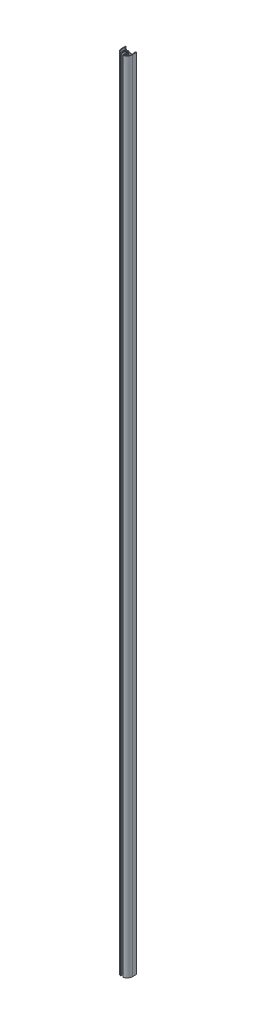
from build123d import *

# Parameters (mm, degrees)
AUFSATZ_LINEAR_AUSTRAGEN1_DEPTH = 2200


with BuildPart() as part:
    # Skizze1 → Aufsatz-Linear austragen1 (new body)
    with BuildSketch(Plane(origin=(0, 0, 0), x_dir=(1, 0, 0), z_dir=(0, 1, 0))):
        with BuildLine():
            Line((-1.200069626, 3.674560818), (-1.200069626, 1.274560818))
            Line((-1.200069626, 1.274560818), (-3.000069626, 1.274560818))
            Line((-3.000069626, 1.274560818), (-3.000069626, -2.275439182))
            Line((-3.000069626, -2.275439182), (-3.250069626, -2.525439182))
            Line((-3.250069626, -2.525439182), (-3.300069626, -2.525439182))
            Line((-3.300069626, -2.525439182), (-3.300069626, -9.025439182))
            Line((-3.300069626, -9.025439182), (-3.200069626, -9.025439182))
            Line((-3.200069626, -9.025439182), (-2.950069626, -9.275439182))
            Line((-2.950069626, -9.275439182), (-2.950069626, -12.609028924))
            ThreePointArc((-2.950069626, -12.609028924), (-3.14715992, -13.006830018), (-3.583052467, -13.091020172))
            ThreePointArc((-3.583052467, -13.091020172), (-11.748706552, -7.734227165), (-15.000069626, 1.474560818))
            Line((-15.000069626, 1.474560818), (-15.000069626, 12.600441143))
            ThreePointArc((-15.000069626, 12.600441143), (-14.635651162, 13.081707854), (-14.073599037, 12.861444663))
            ThreePointArc((-14.073599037, 12.861444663), (-10.343110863, 8.618764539), (-5.400069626, 5.883217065))
            Line((-5.400069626, 5.883217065), (-5.400069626, 2.474560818))
            Line((-5.400069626, 2.474560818), (-2.400069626, 2.474560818))
            Line((-2.400069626, 2.474560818), (-2.400069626, 4.581070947))
            ThreePointArc((-2.400069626, 4.581070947), (-2.233280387, 4.953858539), (-1.844187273, 5.077938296))
            ThreePointArc((-1.844187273, 5.077938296), (-6.9626e-05, 4.974560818), (1.844048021, 5.077938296))
            ThreePointArc((1.844048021, 5.077938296), (2.233141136, 4.953858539), (2.399930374, 4.581070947))
            Line((2.399930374, 4.581070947), (2.399930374, 2.474560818))
            Line((2.399930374, 2.474560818), (13.499930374, 2.474560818))
            Line((13.499930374, 2.474560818), (13.499930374, 8.649809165))
            Line((13.499930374, 8.649809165), (11.999930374, 8.649809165))
            Line((11.999930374, 8.649809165), (11.999930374, 10.149809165))
            ThreePointArc((11.999930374, 10.149809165), (13.123112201, 11.439545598), (14.073459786, 12.861444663))
            ThreePointArc((14.073459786, 12.861444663), (14.637964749, 13.090414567), (14.999930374, 12.600441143))
            Line((14.999930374, 12.600441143), (14.999930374, 1.474560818))
            ThreePointArc((14.999930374, 1.474560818), (11.801084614, -7.784637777), (3.568895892, -13.094669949))
            ThreePointArc((3.568895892, -13.094669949), (3.141290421, -13.002400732), (2.949930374, -12.609028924))
            Line((2.949930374, -12.609028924), (2.949930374, -9.275439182))
            Line((2.949930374, -9.275439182), (3.199930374, -9.025439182))
            Line((3.199930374, -9.025439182), (3.299930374, -9.025439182))
            Line((3.299930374, -9.025439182), (3.299930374, -2.525439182))
            Line((3.299930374, -2.525439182), (2.999930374, -2.275439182))
            Line((2.999930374, -2.275439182), (2.999930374, 1.274560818))
            Line((2.999930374, 1.274560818), (1.199930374, 1.274560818))
            Line((1.199930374, 1.274560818), (1.199930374, 3.674560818))
            Line((1.199930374, 3.674560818), (-1.200069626, 3.674560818))
        make_face()
        with BuildLine():
            Line((-4.300069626, -6.025439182), (-4.300069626, -11.322313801))
            ThreePointArc((-4.300069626, -11.322313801), (-10.927366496, -6.38135199), (-13.500069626, 1.474560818))
            Line((-13.500069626, 1.474560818), (-13.500069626, 9.568679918))
            ThreePointArc((-13.500069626, 9.568679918), (-10.356444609, 6.80518302), (-6.700069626, 4.76797529))
            Line((-6.700069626, 4.76797529), (-6.700069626, 1.274560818))
            Line((-6.700069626, 1.274560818), (-4.300067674, 1.274560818))
            Line((-4.300067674, 1.274560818), (-4.300067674, -1.025436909))
            Line((-4.300067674, -1.025436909), (-6.000067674, -1.025436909))
            ThreePointArc((-6.000067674, -1.025436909), (-6.869356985, -1.181436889), (-7.630159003, -1.629968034))
            ThreePointArc((-7.630159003, -1.629968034), (-7.806864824, -2.209525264), (-7.358437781, -2.616986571))
            ThreePointArc((-7.358437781, -2.616986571), (-7.194965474, -2.56361634), (-7.056958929, -2.461021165))
            ThreePointArc((-7.056958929, -2.461021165), (-4.504485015, -3.517091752), (-7.045035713, -4.601531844))
            ThreePointArc((-7.045035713, -4.601531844), (-7.189997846, -4.495763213), (-7.358439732, -4.43388952))
            ThreePointArc((-7.358439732, -4.43388952), (-7.806154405, -4.842633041), (-7.628571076, -5.422274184))
            ThreePointArc((-7.628571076, -5.422274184), (-6.868376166, -5.869803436), (-6.000069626, -6.025439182))
            Line((-6.000069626, -6.025439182), (-4.300069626, -6.025439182))
        make_face(mode=Mode.SUBTRACT)
        with BuildLine():
            Line((4.299930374, 1.274560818), (13.498448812, 1.274560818))
            ThreePointArc((13.498448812, 1.274560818), (10.954049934, -6.524381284), (4.299930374, -11.322313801))
            Line((4.299930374, -11.322313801), (4.299930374, -6.025439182))
            Line((4.299930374, -6.025439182), (5.999930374, -6.025439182))
            ThreePointArc((5.999930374, -6.025439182), (6.869219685, -5.869439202), (7.630021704, -5.420908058))
            ThreePointArc((7.630021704, -5.420908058), (7.806727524, -4.841350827), (7.358300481, -4.43388952))
            ThreePointArc((7.358300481, -4.43388952), (7.1955834, -4.488719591), (7.056821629, -4.589854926))
            ThreePointArc((7.056821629, -4.589854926), (4.498585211, -3.524488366), (7.058169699, -2.462364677))
            ThreePointArc((7.058169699, -2.462364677), (7.196244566, -2.562952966), (7.358303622, -2.616985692))
            ThreePointArc((7.358303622, -2.616985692), (7.806730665, -2.209524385), (7.630024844, -1.629967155))
            ThreePointArc((7.630024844, -1.629967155), (6.869222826, -1.18143601), (5.999933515, -1.02543603))
            Line((5.999933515, -1.02543603), (4.299933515, -1.02543603))
            Line((4.299933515, -1.02543603), (4.299930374, 1.274560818))
        make_face(mode=Mode.SUBTRACT)
    extrude(amount=-AUFSATZ_LINEAR_AUSTRAGEN1_DEPTH)


solid = part.part
